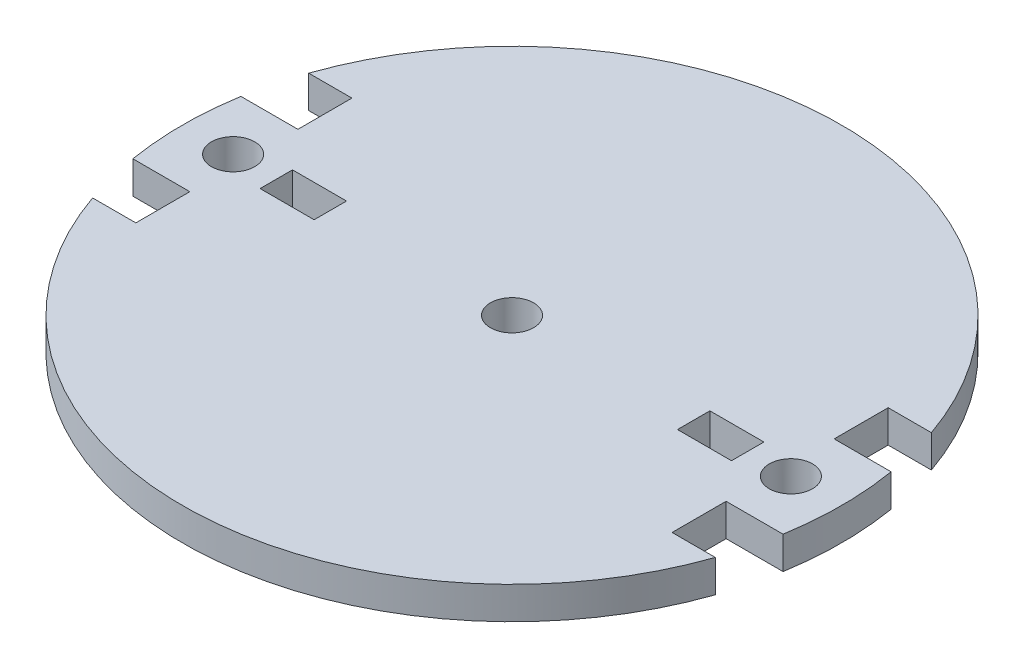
ISO-10303-21;
HEADER;
FILE_DESCRIPTION(('STEP AP214'),'2;1');
FILE_NAME('part.step','',(''),(''),'','','');
FILE_SCHEMA(('AUTOMOTIVE_DESIGN { 1 0 10303 214 1 1 1 1 }'));
ENDSEC;
DATA;
#1=APPLICATION_CONTEXT('core data for automotive mechanical design processes');
#2=APPLICATION_PROTOCOL_DEFINITION('international standard','automotive_design',2000,#1);
#3=PRODUCT_CONTEXT('',#1,'mechanical');
#4=PRODUCT('Part','Part','',(#3));
#5=PRODUCT_RELATED_PRODUCT_CATEGORY('part','',(#4));
#6=PRODUCT_DEFINITION_FORMATION('','',#4);
#7=PRODUCT_DEFINITION_CONTEXT('part definition',#1,'design');
#8=PRODUCT_DEFINITION('design','',#6,#7);
#9=PRODUCT_DEFINITION_SHAPE('','',#8);
#10=(LENGTH_UNIT() NAMED_UNIT(*) SI_UNIT(.MILLI.,.METRE.));
#11=(NAMED_UNIT(*) PLANE_ANGLE_UNIT() SI_UNIT($,.RADIAN.));
#12=(NAMED_UNIT(*) SI_UNIT($,.STERADIAN.) SOLID_ANGLE_UNIT());
#13=UNCERTAINTY_MEASURE_WITH_UNIT(LENGTH_MEASURE(1.E-05),#10,'distance_accuracy_value','');
#14=(GEOMETRIC_REPRESENTATION_CONTEXT(3) GLOBAL_UNCERTAINTY_ASSIGNED_CONTEXT((#13)) GLOBAL_UNIT_ASSIGNED_CONTEXT((#10,
#11,#12)) REPRESENTATION_CONTEXT('',''));
#15=CARTESIAN_POINT('',(0.,0.,0.));
#16=DIRECTION('',(0.,0.,1.));
#17=DIRECTION('',(1.,0.,0.));
#18=AXIS2_PLACEMENT_3D('',#15,#16,#17);
#19=CARTESIAN_POINT('',(0.,3.,0.));
#20=DIRECTION('',(0.,1.,0.));
#21=DIRECTION('',(0.,0.,1.));
#22=AXIS2_PLACEMENT_3D('',#19,#20,#21);
#23=PLANE('',#22);
#24=CARTESIAN_POINT('',(-25.8140590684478,3.,0.));
#25=DIRECTION('',(0.,1.,0.));
#26=DIRECTION('',(0.,0.,1.));
#27=AXIS2_PLACEMENT_3D('',#24,#25,#26);
#28=CIRCLE('',#27,2.);
#29=CARTESIAN_POINT('',(-25.8140590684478,3.,2.));
#30=VERTEX_POINT('',#29);
#31=EDGE_CURVE('E389',#30,#30,#28,.T.);
#32=ORIENTED_EDGE('',*,*,#31,.F.);
#33=EDGE_LOOP('',(#32));
#34=FACE_BOUND('',#33,.T.);
#35=CARTESIAN_POINT('',(25.8140590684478,3.,0.));
#36=DIRECTION('',(0.,1.,0.));
#37=DIRECTION('',(0.,0.,-1.));
#38=AXIS2_PLACEMENT_3D('',#35,#36,#37);
#39=CIRCLE('',#38,2.);
#40=CARTESIAN_POINT('',(25.8140590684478,3.,-2.));
#41=VERTEX_POINT('',#40);
#42=EDGE_CURVE('E381',#41,#41,#39,.T.);
#43=ORIENTED_EDGE('',*,*,#42,.F.);
#44=EDGE_LOOP('',(#43));
#45=FACE_BOUND('',#44,.T.);
#46=DIRECTION('',(1.,0.,0.));
#47=VECTOR('',#46,1.);
#48=CARTESIAN_POINT('',(-16.8140590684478,3.,1.5));
#49=LINE('',#48,#47);
#50=CARTESIAN_POINT('',(-21.8140590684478,3.,1.5));
#51=VERTEX_POINT('',#50);
#52=CARTESIAN_POINT('',(-16.8140590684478,3.,1.5));
#53=VERTEX_POINT('',#52);
#54=EDGE_CURVE('E52',#51,#53,#49,.T.);
#55=ORIENTED_EDGE('',*,*,#54,.F.);
#56=DIRECTION('',(0.,0.,1.));
#57=VECTOR('',#56,1.);
#58=CARTESIAN_POINT('',(-21.8140590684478,3.,1.5));
#59=LINE('',#58,#57);
#60=CARTESIAN_POINT('',(-21.8140590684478,3.,-1.5));
#61=VERTEX_POINT('',#60);
#62=EDGE_CURVE('E216',#61,#51,#59,.T.);
#63=ORIENTED_EDGE('',*,*,#62,.F.);
#64=DIRECTION('',(-1.,0.,0.));
#65=VECTOR('',#64,1.);
#66=CARTESIAN_POINT('',(-16.8140590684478,3.,-1.5));
#67=LINE('',#66,#65);
#68=CARTESIAN_POINT('',(-16.8140590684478,3.,-1.5));
#69=VERTEX_POINT('',#68);
#70=EDGE_CURVE('E201',#69,#61,#67,.T.);
#71=ORIENTED_EDGE('',*,*,#70,.F.);
#72=DIRECTION('',(0.,0.,-1.));
#73=VECTOR('',#72,1.);
#74=CARTESIAN_POINT('',(-16.8140590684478,3.,-1.5));
#75=LINE('',#74,#73);
#76=EDGE_CURVE('E210',#53,#69,#75,.T.);
#77=ORIENTED_EDGE('',*,*,#76,.F.);
#78=EDGE_LOOP('',(#55,#63,#71,#77));
#79=FACE_BOUND('',#78,.T.);
#80=DIRECTION('',(0.,0.,1.));
#81=VECTOR('',#80,1.);
#82=CARTESIAN_POINT('',(16.8140590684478,3.,-1.5));
#83=LINE('',#82,#81);
#84=CARTESIAN_POINT('',(16.8140590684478,3.,-1.5));
#85=VERTEX_POINT('',#84);
#86=CARTESIAN_POINT('',(16.8140590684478,3.,1.5));
#87=VERTEX_POINT('',#86);
#88=EDGE_CURVE('E223',#85,#87,#83,.T.);
#89=ORIENTED_EDGE('',*,*,#88,.F.);
#90=DIRECTION('',(-1.,0.,0.));
#91=VECTOR('',#90,1.);
#92=CARTESIAN_POINT('',(16.8140590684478,3.,-1.5));
#93=LINE('',#92,#91);
#94=CARTESIAN_POINT('',(21.8140590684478,3.,-1.5));
#95=VERTEX_POINT('',#94);
#96=EDGE_CURVE('E233',#95,#85,#93,.T.);
#97=ORIENTED_EDGE('',*,*,#96,.F.);
#98=DIRECTION('',(0.,0.,-1.));
#99=VECTOR('',#98,1.);
#100=CARTESIAN_POINT('',(21.8140590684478,3.,1.5));
#101=LINE('',#100,#99);
#102=CARTESIAN_POINT('',(21.8140590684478,3.,1.5));
#103=VERTEX_POINT('',#102);
#104=EDGE_CURVE('E230',#103,#95,#101,.T.);
#105=ORIENTED_EDGE('',*,*,#104,.F.);
#106=DIRECTION('',(1.,0.,0.));
#107=VECTOR('',#106,1.);
#108=CARTESIAN_POINT('',(16.8140590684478,3.,1.5));
#109=LINE('',#108,#107);
#110=EDGE_CURVE('E227',#87,#103,#109,.T.);
#111=ORIENTED_EDGE('',*,*,#110,.F.);
#112=EDGE_LOOP('',(#89,#97,#105,#111));
#113=FACE_BOUND('',#112,.T.);
#114=CARTESIAN_POINT('',(0.,3.,0.));
#115=DIRECTION('',(0.,1.,0.));
#116=DIRECTION('',(0.,0.,1.));
#117=AXIS2_PLACEMENT_3D('',#114,#115,#116);
#118=CIRCLE('',#117,2.);
#119=CARTESIAN_POINT('',(0.,3.,2.));
#120=VERTEX_POINT('',#119);
#121=EDGE_CURVE('E310',#120,#120,#118,.T.);
#122=ORIENTED_EDGE('',*,*,#121,.F.);
#123=EDGE_LOOP('',(#122));
#124=FACE_BOUND('',#123,.T.);
#125=DIRECTION('',(0.,0.,1.));
#126=VECTOR('',#125,1.);
#127=CARTESIAN_POINT('',(24.8140590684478,3.,0.));
#128=LINE('',#127,#126);
#129=CARTESIAN_POINT('',(24.8140590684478,3.,5.));
#130=VERTEX_POINT('',#129);
#131=CARTESIAN_POINT('',(24.8140590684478,3.,10.));
#132=VERTEX_POINT('',#131);
#133=EDGE_CURVE('E239',#130,#132,#128,.T.);
#134=ORIENTED_EDGE('',*,*,#133,.F.);
#135=DIRECTION('',(1.,0.,0.));
#136=VECTOR('',#135,1.);
#137=CARTESIAN_POINT('',(0.,3.,5.));
#138=LINE('',#137,#136);
#139=CARTESIAN_POINT('',(30.0873727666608,3.,5.));
#140=VERTEX_POINT('',#139);
#141=EDGE_CURVE('E250',#130,#140,#138,.T.);
#142=ORIENTED_EDGE('',*,*,#141,.T.);
#143=CARTESIAN_POINT('',(0.,3.,0.));
#144=DIRECTION('',(0.,1.,0.));
#145=DIRECTION('',(0.,0.,1.));
#146=AXIS2_PLACEMENT_3D('',#143,#144,#145);
#147=CIRCLE('',#146,30.5);
#148=CARTESIAN_POINT('',(30.0873727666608,3.,-5.));
#149=VERTEX_POINT('',#148);
#150=EDGE_CURVE('E324',#140,#149,#147,.T.);
#151=ORIENTED_EDGE('',*,*,#150,.T.);
#152=DIRECTION('',(1.,0.,0.));
#153=VECTOR('',#152,1.);
#154=CARTESIAN_POINT('',(0.,3.,-5.00000000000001));
#155=LINE('',#154,#153);
#156=CARTESIAN_POINT('',(24.8140590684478,3.,-5.));
#157=VERTEX_POINT('',#156);
#158=EDGE_CURVE('E268',#157,#149,#155,.T.);
#159=ORIENTED_EDGE('',*,*,#158,.F.);
#160=DIRECTION('',(0.,0.,-1.));
#161=VECTOR('',#160,1.);
#162=CARTESIAN_POINT('',(24.8140590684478,3.,0.));
#163=LINE('',#162,#161);
#164=CARTESIAN_POINT('',(24.8140590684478,3.,-10.));
#165=VERTEX_POINT('',#164);
#166=EDGE_CURVE('E265',#157,#165,#163,.T.);
#167=ORIENTED_EDGE('',*,*,#166,.T.);
#168=DIRECTION('',(1.,0.,0.));
#169=VECTOR('',#168,1.);
#170=CARTESIAN_POINT('',(0.,3.,-10.));
#171=LINE('',#170,#169);
#172=CARTESIAN_POINT('',(28.8140590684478,3.,-10.));
#173=VERTEX_POINT('',#172);
#174=EDGE_CURVE('E262',#165,#173,#171,.T.);
#175=ORIENTED_EDGE('',*,*,#174,.T.);
#176=CARTESIAN_POINT('',(-28.8140590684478,3.,-10.));
#177=VERTEX_POINT('',#176);
#178=EDGE_CURVE('E712',#173,#177,#147,.T.);
#179=ORIENTED_EDGE('',*,*,#178,.T.);
#180=DIRECTION('',(-1.,0.,0.));
#181=VECTOR('',#180,1.);
#182=CARTESIAN_POINT('',(0.,3.,-10.));
#183=LINE('',#182,#181);
#184=CARTESIAN_POINT('',(-24.8140590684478,3.,-10.));
#185=VERTEX_POINT('',#184);
#186=EDGE_CURVE('E286',#185,#177,#183,.T.);
#187=ORIENTED_EDGE('',*,*,#186,.F.);
#188=DIRECTION('',(0.,0.,-1.));
#189=VECTOR('',#188,1.);
#190=CARTESIAN_POINT('',(-24.8140590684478,3.,0.));
#191=LINE('',#190,#189);
#192=CARTESIAN_POINT('',(-24.8140590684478,3.,-5.));
#193=VERTEX_POINT('',#192);
#194=EDGE_CURVE('E283',#193,#185,#191,.T.);
#195=ORIENTED_EDGE('',*,*,#194,.F.);
#196=DIRECTION('',(-1.,0.,0.));
#197=VECTOR('',#196,1.);
#198=CARTESIAN_POINT('',(0.,3.,-5.));
#199=LINE('',#198,#197);
#200=CARTESIAN_POINT('',(-30.0873727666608,3.,-5.));
#201=VERTEX_POINT('',#200);
#202=EDGE_CURVE('E280',#193,#201,#199,.T.);
#203=ORIENTED_EDGE('',*,*,#202,.T.);
#204=CARTESIAN_POINT('',(-30.0873727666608,3.,5.));
#205=VERTEX_POINT('',#204);
#206=EDGE_CURVE('E325',#201,#205,#147,.T.);
#207=ORIENTED_EDGE('',*,*,#206,.T.);
#208=DIRECTION('',(-1.,0.,0.));
#209=VECTOR('',#208,1.);
#210=CARTESIAN_POINT('',(0.,3.,5.00000000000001));
#211=LINE('',#210,#209);
#212=CARTESIAN_POINT('',(-24.8140590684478,3.,5.));
#213=VERTEX_POINT('',#212);
#214=EDGE_CURVE('E292',#213,#205,#211,.T.);
#215=ORIENTED_EDGE('',*,*,#214,.F.);
#216=DIRECTION('',(0.,0.,1.));
#217=VECTOR('',#216,1.);
#218=CARTESIAN_POINT('',(-24.8140590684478,3.,0.));
#219=LINE('',#218,#217);
#220=CARTESIAN_POINT('',(-24.8140590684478,3.,10.));
#221=VERTEX_POINT('',#220);
#222=EDGE_CURVE('E304',#213,#221,#219,.T.);
#223=ORIENTED_EDGE('',*,*,#222,.T.);
#224=DIRECTION('',(-1.,0.,0.));
#225=VECTOR('',#224,1.);
#226=CARTESIAN_POINT('',(0.,3.,10.));
#227=LINE('',#226,#225);
#228=CARTESIAN_POINT('',(-28.8140590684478,3.,10.));
#229=VERTEX_POINT('',#228);
#230=EDGE_CURVE('E301',#221,#229,#227,.T.);
#231=ORIENTED_EDGE('',*,*,#230,.T.);
#232=CARTESIAN_POINT('',(28.8140590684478,3.,10.));
#233=VERTEX_POINT('',#232);
#234=EDGE_CURVE('E320',#229,#233,#147,.T.);
#235=ORIENTED_EDGE('',*,*,#234,.T.);
#236=DIRECTION('',(1.,0.,0.));
#237=VECTOR('',#236,1.);
#238=CARTESIAN_POINT('',(0.,3.,10.));
#239=LINE('',#238,#237);
#240=EDGE_CURVE('E248',#132,#233,#239,.T.);
#241=ORIENTED_EDGE('',*,*,#240,.F.);
#242=EDGE_LOOP('',(#134,#142,#151,#159,#167,#175,#179,#187,#195,#203,#207,#215,#223,#231,#235,#241));
#243=FACE_BOUND('',#242,.T.);
#244=ADVANCED_FACE('F35',(#34,#45,#79,#113,#124,#243),#23,.T.);
#245=CARTESIAN_POINT('',(0.,0.,0.));
#246=DIRECTION('',(0.,1.,0.));
#247=DIRECTION('',(0.,0.,1.));
#248=AXIS2_PLACEMENT_3D('',#245,#246,#247);
#249=PLANE('',#248);
#250=CARTESIAN_POINT('',(-25.8140590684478,0.,0.));
#251=DIRECTION('',(0.,1.,0.));
#252=DIRECTION('',(0.,0.,1.));
#253=AXIS2_PLACEMENT_3D('',#250,#251,#252);
#254=CIRCLE('',#253,2.);
#255=CARTESIAN_POINT('',(-25.8140590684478,0.,2.));
#256=VERTEX_POINT('',#255);
#257=EDGE_CURVE('E39',#256,#256,#254,.T.);
#258=ORIENTED_EDGE('',*,*,#257,.T.);
#259=EDGE_LOOP('',(#258));
#260=FACE_BOUND('',#259,.T.);
#261=CARTESIAN_POINT('',(25.8140590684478,0.,0.));
#262=DIRECTION('',(0.,1.,0.));
#263=DIRECTION('',(0.,0.,1.));
#264=AXIS2_PLACEMENT_3D('',#261,#262,#263);
#265=CIRCLE('',#264,2.);
#266=CARTESIAN_POINT('',(25.8140590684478,0.,2.));
#267=VERTEX_POINT('',#266);
#268=EDGE_CURVE('E379',#267,#267,#265,.T.);
#269=ORIENTED_EDGE('',*,*,#268,.T.);
#270=EDGE_LOOP('',(#269));
#271=FACE_BOUND('',#270,.T.);
#272=DIRECTION('',(0.,0.,1.));
#273=VECTOR('',#272,1.);
#274=CARTESIAN_POINT('',(-21.8140590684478,0.,0.));
#275=LINE('',#274,#273);
#276=CARTESIAN_POINT('',(-21.8140590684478,0.,-1.5));
#277=VERTEX_POINT('',#276);
#278=CARTESIAN_POINT('',(-21.8140590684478,0.,1.5));
#279=VERTEX_POINT('',#278);
#280=EDGE_CURVE('E44',#277,#279,#275,.T.);
#281=ORIENTED_EDGE('',*,*,#280,.T.);
#282=DIRECTION('',(1.,0.,0.));
#283=VECTOR('',#282,1.);
#284=CARTESIAN_POINT('',(0.,0.,1.5));
#285=LINE('',#284,#283);
#286=CARTESIAN_POINT('',(-16.8140590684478,0.,1.5));
#287=VERTEX_POINT('',#286);
#288=EDGE_CURVE('E11',#279,#287,#285,.T.);
#289=ORIENTED_EDGE('',*,*,#288,.T.);
#290=DIRECTION('',(0.,0.,-1.));
#291=VECTOR('',#290,1.);
#292=CARTESIAN_POINT('',(-16.8140590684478,0.,0.));
#293=LINE('',#292,#291);
#294=CARTESIAN_POINT('',(-16.8140590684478,0.,-1.5));
#295=VERTEX_POINT('',#294);
#296=EDGE_CURVE('E375',#287,#295,#293,.T.);
#297=ORIENTED_EDGE('',*,*,#296,.T.);
#298=DIRECTION('',(-1.,0.,0.));
#299=VECTOR('',#298,1.);
#300=CARTESIAN_POINT('',(0.,0.,-1.5));
#301=LINE('',#300,#299);
#302=EDGE_CURVE('E204',#295,#277,#301,.T.);
#303=ORIENTED_EDGE('',*,*,#302,.T.);
#304=EDGE_LOOP('',(#281,#289,#297,#303));
#305=FACE_BOUND('',#304,.T.);
#306=DIRECTION('',(-1.,0.,0.));
#307=VECTOR('',#306,1.);
#308=CARTESIAN_POINT('',(0.,0.,-1.5));
#309=LINE('',#308,#307);
#310=CARTESIAN_POINT('',(21.8140590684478,0.,-1.5));
#311=VERTEX_POINT('',#310);
#312=CARTESIAN_POINT('',(16.8140590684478,0.,-1.5));
#313=VERTEX_POINT('',#312);
#314=EDGE_CURVE('E369',#311,#313,#309,.T.);
#315=ORIENTED_EDGE('',*,*,#314,.T.);
#316=DIRECTION('',(0.,0.,1.));
#317=VECTOR('',#316,1.);
#318=CARTESIAN_POINT('',(16.8140590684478,0.,0.));
#319=LINE('',#318,#317);
#320=CARTESIAN_POINT('',(16.8140590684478,0.,1.5));
#321=VERTEX_POINT('',#320);
#322=EDGE_CURVE('E372',#313,#321,#319,.T.);
#323=ORIENTED_EDGE('',*,*,#322,.T.);
#324=DIRECTION('',(1.,0.,0.));
#325=VECTOR('',#324,1.);
#326=CARTESIAN_POINT('',(0.,0.,1.5));
#327=LINE('',#326,#325);
#328=CARTESIAN_POINT('',(21.8140590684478,0.,1.5));
#329=VERTEX_POINT('',#328);
#330=EDGE_CURVE('E363',#321,#329,#327,.T.);
#331=ORIENTED_EDGE('',*,*,#330,.T.);
#332=DIRECTION('',(0.,0.,-1.));
#333=VECTOR('',#332,1.);
#334=CARTESIAN_POINT('',(21.8140590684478,0.,0.));
#335=LINE('',#334,#333);
#336=EDGE_CURVE('E366',#329,#311,#335,.T.);
#337=ORIENTED_EDGE('',*,*,#336,.T.);
#338=EDGE_LOOP('',(#315,#323,#331,#337));
#339=FACE_BOUND('',#338,.T.);
#340=CARTESIAN_POINT('',(0.,0.,0.));
#341=DIRECTION('',(0.,1.,0.));
#342=DIRECTION('',(0.,0.,1.));
#343=AXIS2_PLACEMENT_3D('',#340,#341,#342);
#344=CIRCLE('',#343,2.);
#345=CARTESIAN_POINT('',(0.,0.,2.));
#346=VERTEX_POINT('',#345);
#347=EDGE_CURVE('E319',#346,#346,#344,.T.);
#348=ORIENTED_EDGE('',*,*,#347,.T.);
#349=EDGE_LOOP('',(#348));
#350=FACE_BOUND('',#349,.T.);
#351=DIRECTION('',(1.,0.,0.));
#352=VECTOR('',#351,1.);
#353=CARTESIAN_POINT('',(0.,0.,5.));
#354=LINE('',#353,#352);
#355=CARTESIAN_POINT('',(24.8140590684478,0.,5.));
#356=VERTEX_POINT('',#355);
#357=CARTESIAN_POINT('',(30.0873727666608,0.,5.));
#358=VERTEX_POINT('',#357);
#359=EDGE_CURVE('E260',#356,#358,#354,.T.);
#360=ORIENTED_EDGE('',*,*,#359,.F.);
#361=DIRECTION('',(0.,0.,1.));
#362=VECTOR('',#361,1.);
#363=CARTESIAN_POINT('',(24.8140590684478,0.,0.));
#364=LINE('',#363,#362);
#365=CARTESIAN_POINT('',(24.8140590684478,0.,10.));
#366=VERTEX_POINT('',#365);
#367=EDGE_CURVE('E360',#356,#366,#364,.T.);
#368=ORIENTED_EDGE('',*,*,#367,.T.);
#369=DIRECTION('',(1.,0.,0.));
#370=VECTOR('',#369,1.);
#371=CARTESIAN_POINT('',(0.,0.,10.));
#372=LINE('',#371,#370);
#373=CARTESIAN_POINT('',(28.8140590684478,0.,10.));
#374=VERTEX_POINT('',#373);
#375=EDGE_CURVE('E256',#366,#374,#372,.T.);
#376=ORIENTED_EDGE('',*,*,#375,.T.);
#377=CARTESIAN_POINT('',(0.,0.,0.));
#378=DIRECTION('',(0.,1.,0.));
#379=DIRECTION('',(0.,0.,1.));
#380=AXIS2_PLACEMENT_3D('',#377,#378,#379);
#381=CIRCLE('',#380,30.5);
#382=CARTESIAN_POINT('',(-28.8140590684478,0.,10.));
#383=VERTEX_POINT('',#382);
#384=EDGE_CURVE('E326',#383,#374,#381,.T.);
#385=ORIENTED_EDGE('',*,*,#384,.F.);
#386=DIRECTION('',(-1.,0.,0.));
#387=VECTOR('',#386,1.);
#388=CARTESIAN_POINT('',(0.,0.,10.));
#389=LINE('',#388,#387);
#390=CARTESIAN_POINT('',(-24.8140590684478,0.,10.));
#391=VERTEX_POINT('',#390);
#392=EDGE_CURVE('E323',#391,#383,#389,.T.);
#393=ORIENTED_EDGE('',*,*,#392,.F.);
#394=DIRECTION('',(0.,0.,1.));
#395=VECTOR('',#394,1.);
#396=CARTESIAN_POINT('',(-24.8140590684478,0.,0.));
#397=LINE('',#396,#395);
#398=CARTESIAN_POINT('',(-24.8140590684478,0.,5.));
#399=VERTEX_POINT('',#398);
#400=EDGE_CURVE('E334',#399,#391,#397,.T.);
#401=ORIENTED_EDGE('',*,*,#400,.F.);
#402=DIRECTION('',(-1.,0.,0.));
#403=VECTOR('',#402,1.);
#404=CARTESIAN_POINT('',(0.,0.,5.00000000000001));
#405=LINE('',#404,#403);
#406=CARTESIAN_POINT('',(-30.0873727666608,0.,5.));
#407=VERTEX_POINT('',#406);
#408=EDGE_CURVE('E337',#399,#407,#405,.T.);
#409=ORIENTED_EDGE('',*,*,#408,.T.);
#410=CARTESIAN_POINT('',(-30.0873727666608,0.,-5.));
#411=VERTEX_POINT('',#410);
#412=EDGE_CURVE('E330',#411,#407,#381,.T.);
#413=ORIENTED_EDGE('',*,*,#412,.F.);
#414=DIRECTION('',(-1.,0.,0.));
#415=VECTOR('',#414,1.);
#416=CARTESIAN_POINT('',(0.,0.,-5.));
#417=LINE('',#416,#415);
#418=CARTESIAN_POINT('',(-24.8140590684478,0.,-5.));
#419=VERTEX_POINT('',#418);
#420=EDGE_CURVE('E346',#419,#411,#417,.T.);
#421=ORIENTED_EDGE('',*,*,#420,.F.);
#422=DIRECTION('',(0.,0.,-1.));
#423=VECTOR('',#422,1.);
#424=CARTESIAN_POINT('',(-24.8140590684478,0.,0.));
#425=LINE('',#424,#423);
#426=CARTESIAN_POINT('',(-24.8140590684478,0.,-10.));
#427=VERTEX_POINT('',#426);
#428=EDGE_CURVE('E340',#419,#427,#425,.T.);
#429=ORIENTED_EDGE('',*,*,#428,.T.);
#430=DIRECTION('',(-1.,0.,0.));
#431=VECTOR('',#430,1.);
#432=CARTESIAN_POINT('',(0.,0.,-10.));
#433=LINE('',#432,#431);
#434=CARTESIAN_POINT('',(-28.8140590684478,0.,-10.));
#435=VERTEX_POINT('',#434);
#436=EDGE_CURVE('E343',#427,#435,#433,.T.);
#437=ORIENTED_EDGE('',*,*,#436,.T.);
#438=CARTESIAN_POINT('',(28.8140590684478,0.,-10.));
#439=VERTEX_POINT('',#438);
#440=EDGE_CURVE('E692',#439,#435,#381,.T.);
#441=ORIENTED_EDGE('',*,*,#440,.F.);
#442=DIRECTION('',(1.,0.,0.));
#443=VECTOR('',#442,1.);
#444=CARTESIAN_POINT('',(0.,0.,-10.));
#445=LINE('',#444,#443);
#446=CARTESIAN_POINT('',(24.8140590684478,0.,-10.));
#447=VERTEX_POINT('',#446);
#448=EDGE_CURVE('E278',#447,#439,#445,.T.);
#449=ORIENTED_EDGE('',*,*,#448,.F.);
#450=DIRECTION('',(0.,0.,-1.));
#451=VECTOR('',#450,1.);
#452=CARTESIAN_POINT('',(24.8140590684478,0.,0.));
#453=LINE('',#452,#451);
#454=CARTESIAN_POINT('',(24.8140590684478,0.,-5.));
#455=VERTEX_POINT('',#454);
#456=EDGE_CURVE('E353',#455,#447,#453,.T.);
#457=ORIENTED_EDGE('',*,*,#456,.F.);
#458=DIRECTION('',(1.,0.,0.));
#459=VECTOR('',#458,1.);
#460=CARTESIAN_POINT('',(0.,0.,-5.00000000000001));
#461=LINE('',#460,#459);
#462=CARTESIAN_POINT('',(30.0873727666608,0.,-5.));
#463=VERTEX_POINT('',#462);
#464=EDGE_CURVE('E274',#455,#463,#461,.T.);
#465=ORIENTED_EDGE('',*,*,#464,.T.);
#466=EDGE_CURVE('E329',#358,#463,#381,.T.);
#467=ORIENTED_EDGE('',*,*,#466,.F.);
#468=EDGE_LOOP('',(#360,#368,#376,#385,#393,#401,#409,#413,#421,#429,#437,#441,#449,#457,#465,#467));
#469=FACE_BOUND('',#468,.T.);
#470=ADVANCED_FACE('F399',(#260,#271,#305,#339,#350,#469),#249,.F.);
#471=CARTESIAN_POINT('',(0.,3.,0.));
#472=DIRECTION('',(0.,-1.,0.));
#473=DIRECTION('',(0.,0.,-1.));
#474=AXIS2_PLACEMENT_3D('',#471,#472,#473);
#475=CYLINDRICAL_SURFACE('',#474,30.5);
#476=DIRECTION('',(0.,-1.,0.));
#477=VECTOR('',#476,1.);
#478=CARTESIAN_POINT('',(30.0873727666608,3.,5.));
#479=LINE('',#478,#477);
#480=EDGE_CURVE('E358',#358,#140,#479,.F.);
#481=ORIENTED_EDGE('',*,*,#480,.F.);
#482=ORIENTED_EDGE('',*,*,#466,.T.);
#483=DIRECTION('',(0.,-1.,0.));
#484=VECTOR('',#483,1.);
#485=CARTESIAN_POINT('',(30.0873727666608,3.,-5.));
#486=LINE('',#485,#484);
#487=EDGE_CURVE('E348',#463,#149,#486,.F.);
#488=ORIENTED_EDGE('',*,*,#487,.T.);
#489=ORIENTED_EDGE('',*,*,#150,.F.);
#490=EDGE_LOOP('',(#481,#482,#488,#489));
#491=FACE_BOUND('',#490,.T.);
#492=ADVANCED_FACE('F404',(#491),#475,.T.);
#493=DIRECTION('',(0.,-1.,0.));
#494=VECTOR('',#493,1.);
#495=CARTESIAN_POINT('',(28.8140590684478,3.,-10.));
#496=LINE('',#495,#494);
#497=EDGE_CURVE('E351',#439,#173,#496,.F.);
#498=ORIENTED_EDGE('',*,*,#497,.F.);
#499=ORIENTED_EDGE('',*,*,#440,.T.);
#500=DIRECTION('',(0.,1.,0.));
#501=VECTOR('',#500,1.);
#502=CARTESIAN_POINT('',(-28.8140590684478,-1.,-10.));
#503=LINE('',#502,#501);
#504=EDGE_CURVE('E293',#435,#177,#503,.T.);
#505=ORIENTED_EDGE('',*,*,#504,.T.);
#506=ORIENTED_EDGE('',*,*,#178,.F.);
#507=EDGE_LOOP('',(#498,#499,#505,#506));
#508=FACE_BOUND('',#507,.T.);
#509=ADVANCED_FACE('F595',(#508),#475,.T.);
#510=DIRECTION('',(0.,1.,0.));
#511=VECTOR('',#510,1.);
#512=CARTESIAN_POINT('',(-30.0873727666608,-1.,-5.));
#513=LINE('',#512,#511);
#514=EDGE_CURVE('E290',#411,#201,#513,.T.);
#515=ORIENTED_EDGE('',*,*,#514,.F.);
#516=ORIENTED_EDGE('',*,*,#412,.T.);
#517=DIRECTION('',(0.,1.,0.));
#518=VECTOR('',#517,1.);
#519=CARTESIAN_POINT('',(-30.0873727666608,-1.,5.));
#520=LINE('',#519,#518);
#521=EDGE_CURVE('E307',#407,#205,#520,.T.);
#522=ORIENTED_EDGE('',*,*,#521,.T.);
#523=ORIENTED_EDGE('',*,*,#206,.F.);
#524=EDGE_LOOP('',(#515,#516,#522,#523));
#525=FACE_BOUND('',#524,.T.);
#526=ADVANCED_FACE('F588',(#525),#475,.T.);
#527=ORIENTED_EDGE('',*,*,#384,.T.);
#528=DIRECTION('',(0.,-1.,0.));
#529=VECTOR('',#528,1.);
#530=CARTESIAN_POINT('',(28.8140590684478,3.,10.));
#531=LINE('',#530,#529);
#532=EDGE_CURVE('E355',#374,#233,#531,.F.);
#533=ORIENTED_EDGE('',*,*,#532,.T.);
#534=ORIENTED_EDGE('',*,*,#234,.F.);
#535=DIRECTION('',(0.,1.,0.));
#536=VECTOR('',#535,1.);
#537=CARTESIAN_POINT('',(-28.8140590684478,-1.,10.));
#538=LINE('',#537,#536);
#539=EDGE_CURVE('E313',#383,#229,#538,.T.);
#540=ORIENTED_EDGE('',*,*,#539,.F.);
#541=EDGE_LOOP('',(#527,#533,#534,#540));
#542=FACE_BOUND('',#541,.T.);
#543=ADVANCED_FACE('F37',(#542),#475,.T.);
#544=CARTESIAN_POINT('',(0.,-1.,0.));
#545=DIRECTION('',(0.,1.,0.));
#546=DIRECTION('',(0.,0.,1.));
#547=AXIS2_PLACEMENT_3D('',#544,#545,#546);
#548=CYLINDRICAL_SURFACE('',#547,2.);
#549=ORIENTED_EDGE('',*,*,#121,.T.);
#550=EDGE_LOOP('',(#549));
#551=FACE_BOUND('',#550,.T.);
#552=ORIENTED_EDGE('',*,*,#347,.F.);
#553=EDGE_LOOP('',(#552));
#554=FACE_BOUND('',#553,.T.);
#555=ADVANCED_FACE('F407',(#551,#554),#548,.F.);
#556=CARTESIAN_POINT('',(0.,-1.,5.00000000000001));
#557=DIRECTION('',(0.,0.,-1.));
#558=DIRECTION('',(-1.,0.,0.));
#559=AXIS2_PLACEMENT_3D('',#556,#557,#558);
#560=PLANE('',#559);
#561=DIRECTION('',(0.,1.,0.));
#562=VECTOR('',#561,1.);
#563=CARTESIAN_POINT('',(-24.8140590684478,-1.,5.));
#564=LINE('',#563,#562);
#565=EDGE_CURVE('E308',#399,#213,#564,.T.);
#566=ORIENTED_EDGE('',*,*,#565,.T.);
#567=ORIENTED_EDGE('',*,*,#214,.T.);
#568=ORIENTED_EDGE('',*,*,#521,.F.);
#569=ORIENTED_EDGE('',*,*,#408,.F.);
#570=EDGE_LOOP('',(#566,#567,#568,#569));
#571=FACE_BOUND('',#570,.T.);
#572=ADVANCED_FACE('F410',(#571),#560,.F.);
#573=CARTESIAN_POINT('',(-24.8140590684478,-1.,0.));
#574=DIRECTION('',(-1.,0.,0.));
#575=DIRECTION('',(0.,0.,1.));
#576=AXIS2_PLACEMENT_3D('',#573,#574,#575);
#577=PLANE('',#576);
#578=ORIENTED_EDGE('',*,*,#400,.T.);
#579=DIRECTION('',(0.,1.,0.));
#580=VECTOR('',#579,1.);
#581=CARTESIAN_POINT('',(-24.8140590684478,-1.,10.));
#582=LINE('',#581,#580);
#583=EDGE_CURVE('E311',#391,#221,#582,.T.);
#584=ORIENTED_EDGE('',*,*,#583,.T.);
#585=ORIENTED_EDGE('',*,*,#222,.F.);
#586=ORIENTED_EDGE('',*,*,#565,.F.);
#587=EDGE_LOOP('',(#578,#584,#585,#586));
#588=FACE_BOUND('',#587,.T.);
#589=ADVANCED_FACE('F414',(#588),#577,.T.);
#590=CARTESIAN_POINT('',(0.,-1.,10.));
#591=DIRECTION('',(0.,0.,-1.));
#592=DIRECTION('',(-1.,0.,0.));
#593=AXIS2_PLACEMENT_3D('',#590,#591,#592);
#594=PLANE('',#593);
#595=ORIENTED_EDGE('',*,*,#392,.T.);
#596=ORIENTED_EDGE('',*,*,#539,.T.);
#597=ORIENTED_EDGE('',*,*,#230,.F.);
#598=ORIENTED_EDGE('',*,*,#583,.F.);
#599=EDGE_LOOP('',(#595,#596,#597,#598));
#600=FACE_BOUND('',#599,.T.);
#601=ADVANCED_FACE('F416',(#600),#594,.T.);
#602=CARTESIAN_POINT('',(0.,-1.,-5.));
#603=DIRECTION('',(0.,0.,-1.));
#604=DIRECTION('',(-1.,0.,0.));
#605=AXIS2_PLACEMENT_3D('',#602,#603,#604);
#606=PLANE('',#605);
#607=ORIENTED_EDGE('',*,*,#420,.T.);
#608=ORIENTED_EDGE('',*,*,#514,.T.);
#609=ORIENTED_EDGE('',*,*,#202,.F.);
#610=DIRECTION('',(0.,1.,0.));
#611=VECTOR('',#610,1.);
#612=CARTESIAN_POINT('',(-24.8140590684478,-1.,-5.));
#613=LINE('',#612,#611);
#614=EDGE_CURVE('E289',#419,#193,#613,.T.);
#615=ORIENTED_EDGE('',*,*,#614,.F.);
#616=EDGE_LOOP('',(#607,#608,#609,#615));
#617=FACE_BOUND('',#616,.T.);
#618=ADVANCED_FACE('F419',(#617),#606,.T.);
#619=CARTESIAN_POINT('',(0.,-1.,-10.));
#620=DIRECTION('',(0.,0.,-1.));
#621=DIRECTION('',(-1.,0.,0.));
#622=AXIS2_PLACEMENT_3D('',#619,#620,#621);
#623=PLANE('',#622);
#624=DIRECTION('',(0.,1.,0.));
#625=VECTOR('',#624,1.);
#626=CARTESIAN_POINT('',(-24.8140590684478,-1.,-10.));
#627=LINE('',#626,#625);
#628=EDGE_CURVE('E296',#427,#185,#627,.T.);
#629=ORIENTED_EDGE('',*,*,#628,.T.);
#630=ORIENTED_EDGE('',*,*,#186,.T.);
#631=ORIENTED_EDGE('',*,*,#504,.F.);
#632=ORIENTED_EDGE('',*,*,#436,.F.);
#633=EDGE_LOOP('',(#629,#630,#631,#632));
#634=FACE_BOUND('',#633,.T.);
#635=ADVANCED_FACE('F426',(#634),#623,.F.);
#636=CARTESIAN_POINT('',(-24.8140590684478,-1.,0.));
#637=DIRECTION('',(1.,0.,0.));
#638=DIRECTION('',(0.,0.,-1.));
#639=AXIS2_PLACEMENT_3D('',#636,#637,#638);
#640=PLANE('',#639);
#641=ORIENTED_EDGE('',*,*,#614,.T.);
#642=ORIENTED_EDGE('',*,*,#194,.T.);
#643=ORIENTED_EDGE('',*,*,#628,.F.);
#644=ORIENTED_EDGE('',*,*,#428,.F.);
#645=EDGE_LOOP('',(#641,#642,#643,#644));
#646=FACE_BOUND('',#645,.T.);
#647=ADVANCED_FACE('F428',(#646),#640,.F.);
#648=CARTESIAN_POINT('',(24.8140590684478,-1.,0.));
#649=DIRECTION('',(1.,0.,0.));
#650=DIRECTION('',(0.,0.,-1.));
#651=AXIS2_PLACEMENT_3D('',#648,#649,#650);
#652=PLANE('',#651);
#653=ORIENTED_EDGE('',*,*,#456,.T.);
#654=DIRECTION('',(0.,1.,0.));
#655=VECTOR('',#654,1.);
#656=CARTESIAN_POINT('',(24.8140590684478,-1.,-10.));
#657=LINE('',#656,#655);
#658=EDGE_CURVE('E271',#447,#165,#657,.T.);
#659=ORIENTED_EDGE('',*,*,#658,.T.);
#660=ORIENTED_EDGE('',*,*,#166,.F.);
#661=DIRECTION('',(0.,1.,0.));
#662=VECTOR('',#661,1.);
#663=CARTESIAN_POINT('',(24.8140590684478,-1.,-5.));
#664=LINE('',#663,#662);
#665=EDGE_CURVE('E272',#455,#157,#664,.T.);
#666=ORIENTED_EDGE('',*,*,#665,.F.);
#667=EDGE_LOOP('',(#653,#659,#660,#666));
#668=FACE_BOUND('',#667,.T.);
#669=ADVANCED_FACE('F431',(#668),#652,.T.);
#670=CARTESIAN_POINT('',(0.,-1.,-10.));
#671=DIRECTION('',(0.,0.,1.));
#672=DIRECTION('',(1.,0.,0.));
#673=AXIS2_PLACEMENT_3D('',#670,#671,#672);
#674=PLANE('',#673);
#675=ORIENTED_EDGE('',*,*,#448,.T.);
#676=ORIENTED_EDGE('',*,*,#497,.T.);
#677=ORIENTED_EDGE('',*,*,#174,.F.);
#678=ORIENTED_EDGE('',*,*,#658,.F.);
#679=EDGE_LOOP('',(#675,#676,#677,#678));
#680=FACE_BOUND('',#679,.T.);
#681=ADVANCED_FACE('F436',(#680),#674,.T.);
#682=CARTESIAN_POINT('',(0.,-1.,-5.00000000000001));
#683=DIRECTION('',(0.,0.,1.));
#684=DIRECTION('',(1.,0.,0.));
#685=AXIS2_PLACEMENT_3D('',#682,#683,#684);
#686=PLANE('',#685);
#687=ORIENTED_EDGE('',*,*,#665,.T.);
#688=ORIENTED_EDGE('',*,*,#158,.T.);
#689=ORIENTED_EDGE('',*,*,#487,.F.);
#690=ORIENTED_EDGE('',*,*,#464,.F.);
#691=EDGE_LOOP('',(#687,#688,#689,#690));
#692=FACE_BOUND('',#691,.T.);
#693=ADVANCED_FACE('F439',(#692),#686,.F.);
#694=CARTESIAN_POINT('',(24.8140590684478,-1.,0.));
#695=DIRECTION('',(-1.,0.,0.));
#696=DIRECTION('',(0.,0.,1.));
#697=AXIS2_PLACEMENT_3D('',#694,#695,#696);
#698=PLANE('',#697);
#699=DIRECTION('',(0.,1.,0.));
#700=VECTOR('',#699,1.);
#701=CARTESIAN_POINT('',(24.8140590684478,-1.,5.));
#702=LINE('',#701,#700);
#703=EDGE_CURVE('E254',#356,#130,#702,.T.);
#704=ORIENTED_EDGE('',*,*,#703,.T.);
#705=ORIENTED_EDGE('',*,*,#133,.T.);
#706=DIRECTION('',(0.,1.,0.));
#707=VECTOR('',#706,1.);
#708=CARTESIAN_POINT('',(24.8140590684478,-1.,10.));
#709=LINE('',#708,#707);
#710=EDGE_CURVE('E253',#366,#132,#709,.T.);
#711=ORIENTED_EDGE('',*,*,#710,.F.);
#712=ORIENTED_EDGE('',*,*,#367,.F.);
#713=EDGE_LOOP('',(#704,#705,#711,#712));
#714=FACE_BOUND('',#713,.T.);
#715=ADVANCED_FACE('F446',(#714),#698,.F.);
#716=CARTESIAN_POINT('',(0.,-1.,5.));
#717=DIRECTION('',(0.,0.,1.));
#718=DIRECTION('',(1.,0.,0.));
#719=AXIS2_PLACEMENT_3D('',#716,#717,#718);
#720=PLANE('',#719);
#721=ORIENTED_EDGE('',*,*,#359,.T.);
#722=ORIENTED_EDGE('',*,*,#480,.T.);
#723=ORIENTED_EDGE('',*,*,#141,.F.);
#724=ORIENTED_EDGE('',*,*,#703,.F.);
#725=EDGE_LOOP('',(#721,#722,#723,#724));
#726=FACE_BOUND('',#725,.T.);
#727=ADVANCED_FACE('F450',(#726),#720,.T.);
#728=CARTESIAN_POINT('',(0.,-1.,10.));
#729=DIRECTION('',(0.,0.,1.));
#730=DIRECTION('',(1.,0.,0.));
#731=AXIS2_PLACEMENT_3D('',#728,#729,#730);
#732=PLANE('',#731);
#733=ORIENTED_EDGE('',*,*,#710,.T.);
#734=ORIENTED_EDGE('',*,*,#240,.T.);
#735=ORIENTED_EDGE('',*,*,#532,.F.);
#736=ORIENTED_EDGE('',*,*,#375,.F.);
#737=EDGE_LOOP('',(#733,#734,#735,#736));
#738=FACE_BOUND('',#737,.T.);
#739=ADVANCED_FACE('F452',(#738),#732,.F.);
#740=CARTESIAN_POINT('',(16.8140590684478,-1.,-1.5));
#741=DIRECTION('',(-1.,0.,0.));
#742=DIRECTION('',(0.,0.,1.));
#743=AXIS2_PLACEMENT_3D('',#740,#741,#742);
#744=PLANE('',#743);
#745=DIRECTION('',(0.,1.,0.));
#746=VECTOR('',#745,1.);
#747=CARTESIAN_POINT('',(16.8140590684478,-1.,-1.5));
#748=LINE('',#747,#746);
#749=EDGE_CURVE('E237',#313,#85,#748,.T.);
#750=ORIENTED_EDGE('',*,*,#749,.T.);
#751=ORIENTED_EDGE('',*,*,#88,.T.);
#752=DIRECTION('',(0.,1.,0.));
#753=VECTOR('',#752,1.);
#754=CARTESIAN_POINT('',(16.8140590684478,-1.,1.5));
#755=LINE('',#754,#753);
#756=EDGE_CURVE('E236',#321,#87,#755,.T.);
#757=ORIENTED_EDGE('',*,*,#756,.F.);
#758=ORIENTED_EDGE('',*,*,#322,.F.);
#759=EDGE_LOOP('',(#750,#751,#757,#758));
#760=FACE_BOUND('',#759,.T.);
#761=ADVANCED_FACE('F455',(#760),#744,.F.);
#762=CARTESIAN_POINT('',(16.8140590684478,-1.,-1.5));
#763=DIRECTION('',(0.,0.,-1.));
#764=DIRECTION('',(-1.,0.,0.));
#765=AXIS2_PLACEMENT_3D('',#762,#763,#764);
#766=PLANE('',#765);
#767=DIRECTION('',(0.,1.,0.));
#768=VECTOR('',#767,1.);
#769=CARTESIAN_POINT('',(21.8140590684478,-1.,-1.5));
#770=LINE('',#769,#768);
#771=EDGE_CURVE('E240',#311,#95,#770,.T.);
#772=ORIENTED_EDGE('',*,*,#771,.T.);
#773=ORIENTED_EDGE('',*,*,#96,.T.);
#774=ORIENTED_EDGE('',*,*,#749,.F.);
#775=ORIENTED_EDGE('',*,*,#314,.F.);
#776=EDGE_LOOP('',(#772,#773,#774,#775));
#777=FACE_BOUND('',#776,.T.);
#778=ADVANCED_FACE('F462',(#777),#766,.F.);
#779=CARTESIAN_POINT('',(21.8140590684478,-1.,1.5));
#780=DIRECTION('',(1.,0.,0.));
#781=DIRECTION('',(0.,0.,-1.));
#782=AXIS2_PLACEMENT_3D('',#779,#780,#781);
#783=PLANE('',#782);
#784=DIRECTION('',(0.,1.,0.));
#785=VECTOR('',#784,1.);
#786=CARTESIAN_POINT('',(21.8140590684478,-1.,1.5));
#787=LINE('',#786,#785);
#788=EDGE_CURVE('E242',#329,#103,#787,.T.);
#789=ORIENTED_EDGE('',*,*,#788,.T.);
#790=ORIENTED_EDGE('',*,*,#104,.T.);
#791=ORIENTED_EDGE('',*,*,#771,.F.);
#792=ORIENTED_EDGE('',*,*,#336,.F.);
#793=EDGE_LOOP('',(#789,#790,#791,#792));
#794=FACE_BOUND('',#793,.T.);
#795=ADVANCED_FACE('F468',(#794),#783,.F.);
#796=CARTESIAN_POINT('',(16.8140590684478,-1.,1.5));
#797=DIRECTION('',(0.,0.,1.));
#798=DIRECTION('',(1.,0.,0.));
#799=AXIS2_PLACEMENT_3D('',#796,#797,#798);
#800=PLANE('',#799);
#801=ORIENTED_EDGE('',*,*,#756,.T.);
#802=ORIENTED_EDGE('',*,*,#110,.T.);
#803=ORIENTED_EDGE('',*,*,#788,.F.);
#804=ORIENTED_EDGE('',*,*,#330,.F.);
#805=EDGE_LOOP('',(#801,#802,#803,#804));
#806=FACE_BOUND('',#805,.T.);
#807=ADVANCED_FACE('F464',(#806),#800,.F.);
#808=CARTESIAN_POINT('',(-16.8140590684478,-1.,1.5));
#809=DIRECTION('',(0.,0.,1.));
#810=DIRECTION('',(1.,0.,0.));
#811=AXIS2_PLACEMENT_3D('',#808,#809,#810);
#812=PLANE('',#811);
#813=DIRECTION('',(0.,1.,0.));
#814=VECTOR('',#813,1.);
#815=CARTESIAN_POINT('',(-21.8140590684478,-1.,1.5));
#816=LINE('',#815,#814);
#817=EDGE_CURVE('E221',#279,#51,#816,.T.);
#818=ORIENTED_EDGE('',*,*,#817,.T.);
#819=ORIENTED_EDGE('',*,*,#54,.T.);
#820=DIRECTION('',(0.,1.,0.));
#821=VECTOR('',#820,1.);
#822=CARTESIAN_POINT('',(-16.8140590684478,-1.,1.5));
#823=LINE('',#822,#821);
#824=EDGE_CURVE('E207',#287,#53,#823,.T.);
#825=ORIENTED_EDGE('',*,*,#824,.F.);
#826=ORIENTED_EDGE('',*,*,#288,.F.);
#827=EDGE_LOOP('',(#818,#819,#825,#826));
#828=FACE_BOUND('',#827,.T.);
#829=ADVANCED_FACE('F467',(#828),#812,.F.);
#830=CARTESIAN_POINT('',(-21.8140590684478,-1.,1.5));
#831=DIRECTION('',(-1.,0.,0.));
#832=DIRECTION('',(0.,0.,1.));
#833=AXIS2_PLACEMENT_3D('',#830,#831,#832);
#834=PLANE('',#833);
#835=DIRECTION('',(0.,1.,0.));
#836=VECTOR('',#835,1.);
#837=CARTESIAN_POINT('',(-21.8140590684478,-1.,-1.5));
#838=LINE('',#837,#836);
#839=EDGE_CURVE('E206',#277,#61,#838,.T.);
#840=ORIENTED_EDGE('',*,*,#839,.T.);
#841=ORIENTED_EDGE('',*,*,#62,.T.);
#842=ORIENTED_EDGE('',*,*,#817,.F.);
#843=ORIENTED_EDGE('',*,*,#280,.F.);
#844=EDGE_LOOP('',(#840,#841,#842,#843));
#845=FACE_BOUND('',#844,.T.);
#846=ADVANCED_FACE('F478',(#845),#834,.F.);
#847=CARTESIAN_POINT('',(-16.8140590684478,-1.,-1.5));
#848=DIRECTION('',(0.,0.,-1.));
#849=DIRECTION('',(-1.,0.,0.));
#850=AXIS2_PLACEMENT_3D('',#847,#848,#849);
#851=PLANE('',#850);
#852=DIRECTION('',(0.,1.,0.));
#853=VECTOR('',#852,1.);
#854=CARTESIAN_POINT('',(-16.8140590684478,-1.,-1.5));
#855=LINE('',#854,#853);
#856=EDGE_CURVE('E60',#295,#69,#855,.T.);
#857=ORIENTED_EDGE('',*,*,#856,.T.);
#858=ORIENTED_EDGE('',*,*,#70,.T.);
#859=ORIENTED_EDGE('',*,*,#839,.F.);
#860=ORIENTED_EDGE('',*,*,#302,.F.);
#861=EDGE_LOOP('',(#857,#858,#859,#860));
#862=FACE_BOUND('',#861,.T.);
#863=ADVANCED_FACE('F198',(#862),#851,.F.);
#864=CARTESIAN_POINT('',(-16.8140590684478,-1.,-1.5));
#865=DIRECTION('',(1.,0.,0.));
#866=DIRECTION('',(0.,0.,-1.));
#867=AXIS2_PLACEMENT_3D('',#864,#865,#866);
#868=PLANE('',#867);
#869=ORIENTED_EDGE('',*,*,#824,.T.);
#870=ORIENTED_EDGE('',*,*,#76,.T.);
#871=ORIENTED_EDGE('',*,*,#856,.F.);
#872=ORIENTED_EDGE('',*,*,#296,.F.);
#873=EDGE_LOOP('',(#869,#870,#871,#872));
#874=FACE_BOUND('',#873,.T.);
#875=ADVANCED_FACE('F211',(#874),#868,.F.);
#876=CARTESIAN_POINT('',(25.8140590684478,-1.,0.));
#877=DIRECTION('',(0.,1.,0.));
#878=DIRECTION('',(0.,0.,1.));
#879=AXIS2_PLACEMENT_3D('',#876,#877,#878);
#880=CYLINDRICAL_SURFACE('',#879,2.);
#881=ORIENTED_EDGE('',*,*,#42,.T.);
#882=EDGE_LOOP('',(#881));
#883=FACE_BOUND('',#882,.T.);
#884=ORIENTED_EDGE('',*,*,#268,.F.);
#885=EDGE_LOOP('',(#884));
#886=FACE_BOUND('',#885,.T.);
#887=ADVANCED_FACE('F481',(#883,#886),#880,.F.);
#888=CARTESIAN_POINT('',(-25.8140590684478,-1.,0.));
#889=DIRECTION('',(0.,1.,0.));
#890=DIRECTION('',(0.,0.,1.));
#891=AXIS2_PLACEMENT_3D('',#888,#889,#890);
#892=CYLINDRICAL_SURFACE('',#891,2.);
#893=ORIENTED_EDGE('',*,*,#31,.T.);
#894=EDGE_LOOP('',(#893));
#895=FACE_BOUND('',#894,.T.);
#896=ORIENTED_EDGE('',*,*,#257,.F.);
#897=EDGE_LOOP('',(#896));
#898=FACE_BOUND('',#897,.T.);
#899=ADVANCED_FACE('F394',(#895,#898),#892,.F.);
#900=CLOSED_SHELL('',(#244,#470,#492,#509,#526,#543,#555,#572,#589,#601,#618,#635,#647,#669,
#681,#693,#715,#727,#739,#761,#778,#795,#807,#829,#846,#863,#875,#887,#899));
#901=MANIFOLD_SOLID_BREP('B2',#900);
#902=ADVANCED_BREP_SHAPE_REPRESENTATION('',(#18,#901),#14);
#903=SHAPE_DEFINITION_REPRESENTATION(#9,#902);
ENDSEC;
END-ISO-10303-21;
